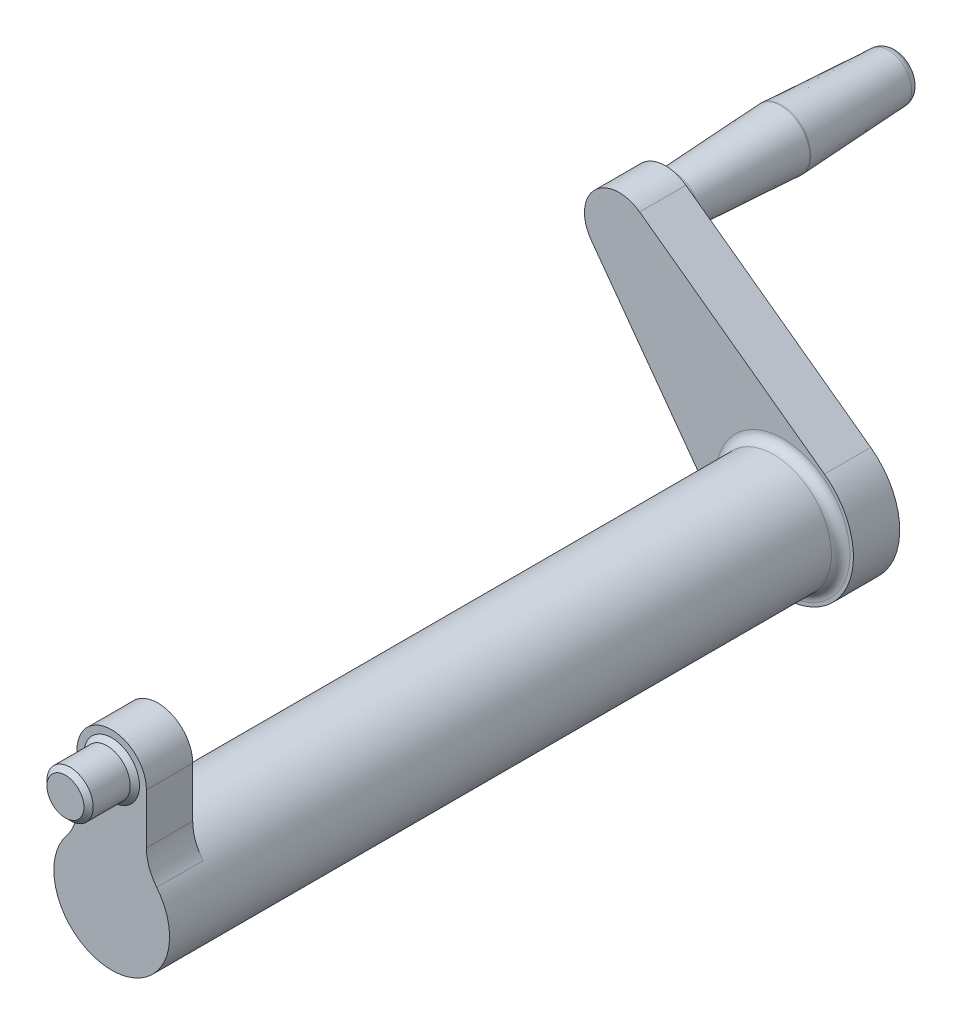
ISO-10303-21;
HEADER;
FILE_DESCRIPTION(('STEP AP214'),'2;1');
FILE_NAME('part.step','',(''),(''),'','','');
FILE_SCHEMA(('AUTOMOTIVE_DESIGN { 1 0 10303 214 1 1 1 1 }'));
ENDSEC;
DATA;
#1=APPLICATION_CONTEXT('core data for automotive mechanical design processes');
#2=APPLICATION_PROTOCOL_DEFINITION('international standard','automotive_design',2000,#1);
#3=PRODUCT_CONTEXT('',#1,'mechanical');
#4=PRODUCT('Part','Part','',(#3));
#5=PRODUCT_RELATED_PRODUCT_CATEGORY('part','',(#4));
#6=PRODUCT_DEFINITION_FORMATION('','',#4);
#7=PRODUCT_DEFINITION_CONTEXT('part definition',#1,'design');
#8=PRODUCT_DEFINITION('design','',#6,#7);
#9=PRODUCT_DEFINITION_SHAPE('','',#8);
#10=(LENGTH_UNIT() NAMED_UNIT(*) SI_UNIT(.MILLI.,.METRE.));
#11=(NAMED_UNIT(*) PLANE_ANGLE_UNIT() SI_UNIT($,.RADIAN.));
#12=(NAMED_UNIT(*) SI_UNIT($,.STERADIAN.) SOLID_ANGLE_UNIT());
#13=UNCERTAINTY_MEASURE_WITH_UNIT(LENGTH_MEASURE(1.E-05),#10,'distance_accuracy_value','');
#14=(GEOMETRIC_REPRESENTATION_CONTEXT(3) GLOBAL_UNCERTAINTY_ASSIGNED_CONTEXT((#13)) GLOBAL_UNIT_ASSIGNED_CONTEXT((#10,
#11,#12)) REPRESENTATION_CONTEXT('',''));
#15=CARTESIAN_POINT('',(0.,0.,0.));
#16=DIRECTION('',(0.,0.,1.));
#17=DIRECTION('',(1.,0.,0.));
#18=AXIS2_PLACEMENT_3D('',#15,#16,#17);
#19=CARTESIAN_POINT('',(0.,0.,145.));
#20=DIRECTION('',(0.,0.,-1.));
#21=DIRECTION('',(-1.,0.,0.));
#22=AXIS2_PLACEMENT_3D('',#19,#20,#21);
#23=CYLINDRICAL_SURFACE('',#22,12.5);
#24=CARTESIAN_POINT('',(0.,0.,12.));
#25=DIRECTION('',(0.,0.,-1.));
#26=DIRECTION('',(-1.,0.,0.));
#27=AXIS2_PLACEMENT_3D('',#24,#25,#26);
#28=CIRCLE('',#27,12.5);
#29=CARTESIAN_POINT('',(-12.5,0.,12.));
#30=VERTEX_POINT('',#29);
#31=EDGE_CURVE('E213',#30,#30,#28,.F.);
#32=ORIENTED_EDGE('',*,*,#31,.T.);
#33=EDGE_LOOP('',(#32));
#34=FACE_BOUND('',#33,.T.);
#35=CARTESIAN_POINT('',(0.,0.,155.));
#36=DIRECTION('',(0.,0.,1.));
#37=DIRECTION('',(1.,0.,0.));
#38=AXIS2_PLACEMENT_3D('',#35,#36,#37);
#39=CIRCLE('',#38,12.5);
#40=CARTESIAN_POINT('',(-9.72222222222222,7.85674201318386,155.));
#41=VERTEX_POINT('',#40);
#42=CARTESIAN_POINT('',(9.72222222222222,7.85674201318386,155.));
#43=VERTEX_POINT('',#42);
#44=EDGE_CURVE('E160',#41,#43,#39,.T.);
#45=ORIENTED_EDGE('',*,*,#44,.F.);
#46=DIRECTION('',(0.,0.,-1.));
#47=VECTOR('',#46,1.);
#48=CARTESIAN_POINT('',(-9.72222222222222,7.85674201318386,145.));
#49=LINE('',#48,#47);
#50=CARTESIAN_POINT('',(-9.72222222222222,7.85674201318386,145.));
#51=VERTEX_POINT('',#50);
#52=EDGE_CURVE('E197',#41,#51,#49,.T.);
#53=ORIENTED_EDGE('',*,*,#52,.T.);
#54=CARTESIAN_POINT('',(0.,0.,145.));
#55=DIRECTION('',(0.,0.,1.));
#56=DIRECTION('',(1.,0.,0.));
#57=AXIS2_PLACEMENT_3D('',#54,#55,#56);
#58=CIRCLE('',#57,12.5);
#59=CARTESIAN_POINT('',(9.72222222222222,7.85674201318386,145.));
#60=VERTEX_POINT('',#59);
#61=EDGE_CURVE('E181',#60,#51,#58,.T.);
#62=ORIENTED_EDGE('',*,*,#61,.F.);
#63=DIRECTION('',(0.,0.,-1.));
#64=VECTOR('',#63,1.);
#65=CARTESIAN_POINT('',(9.72222222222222,7.85674201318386,145.));
#66=LINE('',#65,#64);
#67=EDGE_CURVE('E195',#60,#43,#66,.F.);
#68=ORIENTED_EDGE('',*,*,#67,.T.);
#69=EDGE_LOOP('',(#45,#53,#62,#68));
#70=FACE_BOUND('',#69,.T.);
#71=ADVANCED_FACE('F37',(#34,#70),#23,.T.);
#72=CARTESIAN_POINT('',(0.,0.,145.));
#73=DIRECTION('',(0.,0.,1.));
#74=DIRECTION('',(1.,0.,0.));
#75=AXIS2_PLACEMENT_3D('',#72,#73,#74);
#76=PLANE('',#75);
#77=DIRECTION('',(0.,1.,0.));
#78=VECTOR('',#77,1.);
#79=CARTESIAN_POINT('',(7.5,25.,145.));
#80=LINE('',#79,#78);
#81=CARTESIAN_POINT('',(7.5,14.142135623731,145.));
#82=VERTEX_POINT('',#81);
#83=CARTESIAN_POINT('',(7.5,25.,145.));
#84=VERTEX_POINT('',#83);
#85=EDGE_CURVE('E156',#82,#84,#80,.T.);
#86=ORIENTED_EDGE('',*,*,#85,.F.);
#87=CARTESIAN_POINT('',(17.5,14.142135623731,145.));
#88=DIRECTION('',(0.,0.,1.));
#89=DIRECTION('',(1.,0.,0.));
#90=AXIS2_PLACEMENT_3D('',#87,#88,#89);
#91=CIRCLE('',#90,10.);
#92=EDGE_CURVE('E60',#82,#60,#91,.T.);
#93=ORIENTED_EDGE('',*,*,#92,.T.);
#94=ORIENTED_EDGE('',*,*,#61,.T.);
#95=CARTESIAN_POINT('',(-17.5,14.142135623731,145.));
#96=DIRECTION('',(0.,0.,1.));
#97=DIRECTION('',(1.,0.,0.));
#98=AXIS2_PLACEMENT_3D('',#95,#96,#97);
#99=CIRCLE('',#98,10.);
#100=CARTESIAN_POINT('',(-7.5,14.142135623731,145.));
#101=VERTEX_POINT('',#100);
#102=EDGE_CURVE('E204',#51,#101,#99,.T.);
#103=ORIENTED_EDGE('',*,*,#102,.T.);
#104=DIRECTION('',(0.,-1.,0.));
#105=VECTOR('',#104,1.);
#106=CARTESIAN_POINT('',(-7.5,25.,145.));
#107=LINE('',#106,#105);
#108=CARTESIAN_POINT('',(-7.5,25.,145.));
#109=VERTEX_POINT('',#108);
#110=EDGE_CURVE('E163',#109,#101,#107,.T.);
#111=ORIENTED_EDGE('',*,*,#110,.F.);
#112=CARTESIAN_POINT('',(0.,25.,145.));
#113=DIRECTION('',(0.,0.,1.));
#114=DIRECTION('',(1.,0.,0.));
#115=AXIS2_PLACEMENT_3D('',#112,#113,#114);
#116=CIRCLE('',#115,7.5);
#117=EDGE_CURVE('E172',#84,#109,#116,.T.);
#118=ORIENTED_EDGE('',*,*,#117,.F.);
#119=EDGE_LOOP('',(#86,#93,#94,#103,#111,#118));
#120=FACE_BOUND('',#119,.T.);
#121=ADVANCED_FACE('F253',(#120),#76,.F.);
#122=CARTESIAN_POINT('',(7.5,25.,155.));
#123=DIRECTION('',(-1.,0.,0.));
#124=DIRECTION('',(0.,-1.,0.));
#125=AXIS2_PLACEMENT_3D('',#122,#123,#124);
#126=PLANE('',#125);
#127=DIRECTION('',(0.,1.,0.));
#128=VECTOR('',#127,1.);
#129=CARTESIAN_POINT('',(7.5,25.,155.));
#130=LINE('',#129,#128);
#131=CARTESIAN_POINT('',(7.5,14.142135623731,155.));
#132=VERTEX_POINT('',#131);
#133=CARTESIAN_POINT('',(7.5,25.,155.));
#134=VERTEX_POINT('',#133);
#135=EDGE_CURVE('E162',#132,#134,#130,.T.);
#136=ORIENTED_EDGE('',*,*,#135,.F.);
#137=DIRECTION('',(0.,0.,1.));
#138=VECTOR('',#137,1.);
#139=CARTESIAN_POINT('',(7.5,14.142135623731,145.));
#140=LINE('',#139,#138);
#141=EDGE_CURVE('E202',#132,#82,#140,.F.);
#142=ORIENTED_EDGE('',*,*,#141,.T.);
#143=ORIENTED_EDGE('',*,*,#85,.T.);
#144=DIRECTION('',(0.,0.,-1.));
#145=VECTOR('',#144,1.);
#146=CARTESIAN_POINT('',(7.5,25.,155.));
#147=LINE('',#146,#145);
#148=EDGE_CURVE('E178',#134,#84,#147,.T.);
#149=ORIENTED_EDGE('',*,*,#148,.F.);
#150=EDGE_LOOP('',(#136,#142,#143,#149));
#151=FACE_BOUND('',#150,.T.);
#152=ADVANCED_FACE('F259',(#151),#126,.F.);
#153=CARTESIAN_POINT('',(0.,25.,155.));
#154=DIRECTION('',(0.,0.,-1.));
#155=DIRECTION('',(-1.,0.,0.));
#156=AXIS2_PLACEMENT_3D('',#153,#154,#155);
#157=CYLINDRICAL_SURFACE('',#156,7.5);
#158=ORIENTED_EDGE('',*,*,#117,.T.);
#159=DIRECTION('',(0.,0.,-1.));
#160=VECTOR('',#159,1.);
#161=CARTESIAN_POINT('',(-7.5,25.,155.));
#162=LINE('',#161,#160);
#163=CARTESIAN_POINT('',(-7.5,25.,155.));
#164=VERTEX_POINT('',#163);
#165=EDGE_CURVE('E170',#164,#109,#162,.T.);
#166=ORIENTED_EDGE('',*,*,#165,.F.);
#167=CARTESIAN_POINT('',(0.,25.,155.));
#168=DIRECTION('',(0.,0.,1.));
#169=DIRECTION('',(1.,0.,0.));
#170=AXIS2_PLACEMENT_3D('',#167,#168,#169);
#171=CIRCLE('',#170,7.5);
#172=EDGE_CURVE('E165',#134,#164,#171,.T.);
#173=ORIENTED_EDGE('',*,*,#172,.F.);
#174=ORIENTED_EDGE('',*,*,#148,.T.);
#175=EDGE_LOOP('',(#158,#166,#173,#174));
#176=FACE_BOUND('',#175,.T.);
#177=ADVANCED_FACE('F451',(#176),#157,.T.);
#178=CARTESIAN_POINT('',(-7.5,25.,155.));
#179=DIRECTION('',(1.,0.,0.));
#180=DIRECTION('',(0.,1.,0.));
#181=AXIS2_PLACEMENT_3D('',#178,#179,#180);
#182=PLANE('',#181);
#183=ORIENTED_EDGE('',*,*,#110,.T.);
#184=DIRECTION('',(0.,0.,1.));
#185=VECTOR('',#184,1.);
#186=CARTESIAN_POINT('',(-7.5,14.142135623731,155.));
#187=LINE('',#186,#185);
#188=CARTESIAN_POINT('',(-7.5,14.142135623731,155.));
#189=VERTEX_POINT('',#188);
#190=EDGE_CURVE('E200',#101,#189,#187,.T.);
#191=ORIENTED_EDGE('',*,*,#190,.T.);
#192=DIRECTION('',(0.,-1.,0.));
#193=VECTOR('',#192,1.);
#194=CARTESIAN_POINT('',(-7.5,25.,155.));
#195=LINE('',#194,#193);
#196=EDGE_CURVE('E167',#164,#189,#195,.T.);
#197=ORIENTED_EDGE('',*,*,#196,.F.);
#198=ORIENTED_EDGE('',*,*,#165,.T.);
#199=EDGE_LOOP('',(#183,#191,#197,#198));
#200=FACE_BOUND('',#199,.T.);
#201=ADVANCED_FACE('F442',(#200),#182,.F.);
#202=CARTESIAN_POINT('',(0.,0.,155.));
#203=DIRECTION('',(0.,0.,1.));
#204=DIRECTION('',(1.,0.,0.));
#205=AXIS2_PLACEMENT_3D('',#202,#203,#204);
#206=PLANE('',#205);
#207=CARTESIAN_POINT('',(0.,25.,155.));
#208=DIRECTION('',(0.,0.,1.));
#209=DIRECTION('',(1.,0.,0.));
#210=AXIS2_PLACEMENT_3D('',#207,#208,#209);
#211=CIRCLE('',#210,6.00000000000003);
#212=CARTESIAN_POINT('',(6.00000000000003,25.,155.));
#213=VERTEX_POINT('',#212);
#214=EDGE_CURVE('E192',#213,#213,#211,.F.);
#215=ORIENTED_EDGE('',*,*,#214,.T.);
#216=EDGE_LOOP('',(#215));
#217=FACE_BOUND('',#216,.T.);
#218=ORIENTED_EDGE('',*,*,#196,.T.);
#219=CARTESIAN_POINT('',(-17.5,14.142135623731,155.));
#220=DIRECTION('',(0.,0.,1.));
#221=DIRECTION('',(1.,0.,0.));
#222=AXIS2_PLACEMENT_3D('',#219,#220,#221);
#223=CIRCLE('',#222,10.);
#224=EDGE_CURVE('E206',#189,#41,#223,.F.);
#225=ORIENTED_EDGE('',*,*,#224,.T.);
#226=ORIENTED_EDGE('',*,*,#44,.T.);
#227=CARTESIAN_POINT('',(17.5,14.142135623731,155.));
#228=DIRECTION('',(0.,0.,1.));
#229=DIRECTION('',(1.,0.,0.));
#230=AXIS2_PLACEMENT_3D('',#227,#228,#229);
#231=CIRCLE('',#230,10.);
#232=EDGE_CURVE('E52',#43,#132,#231,.F.);
#233=ORIENTED_EDGE('',*,*,#232,.T.);
#234=ORIENTED_EDGE('',*,*,#135,.T.);
#235=ORIENTED_EDGE('',*,*,#172,.T.);
#236=EDGE_LOOP('',(#218,#225,#226,#233,#234,#235));
#237=FACE_BOUND('',#236,.T.);
#238=ADVANCED_FACE('F433',(#217,#237),#206,.T.);
#239=CARTESIAN_POINT('',(0.,25.,165.));
#240=DIRECTION('',(0.,0.,-1.));
#241=DIRECTION('',(-1.,0.,0.));
#242=AXIS2_PLACEMENT_3D('',#239,#240,#241);
#243=CYLINDRICAL_SURFACE('',#242,5.);
#244=CARTESIAN_POINT('',(0.,25.,164.));
#245=DIRECTION('',(0.,0.,1.));
#246=DIRECTION('',(1.,0.,0.));
#247=AXIS2_PLACEMENT_3D('',#244,#245,#246);
#248=CIRCLE('',#247,5.);
#249=CARTESIAN_POINT('',(5.,25.,164.));
#250=VERTEX_POINT('',#249);
#251=EDGE_CURVE('E189',#250,#250,#248,.F.);
#252=ORIENTED_EDGE('',*,*,#251,.T.);
#253=EDGE_LOOP('',(#252));
#254=FACE_BOUND('',#253,.T.);
#255=CARTESIAN_POINT('',(0.,25.,156.));
#256=DIRECTION('',(0.,0.,1.));
#257=DIRECTION('',(1.,0.,0.));
#258=AXIS2_PLACEMENT_3D('',#255,#256,#257);
#259=CIRCLE('',#258,5.);
#260=CARTESIAN_POINT('',(5.,25.,156.));
#261=VERTEX_POINT('',#260);
#262=EDGE_CURVE('E186',#261,#261,#259,.T.);
#263=ORIENTED_EDGE('',*,*,#262,.T.);
#264=EDGE_LOOP('',(#263));
#265=FACE_BOUND('',#264,.T.);
#266=ADVANCED_FACE('F424',(#254,#265),#243,.T.);
#267=CARTESIAN_POINT('',(0.,25.,165.));
#268=DIRECTION('',(0.,0.,1.));
#269=DIRECTION('',(1.,0.,0.));
#270=AXIS2_PLACEMENT_3D('',#267,#268,#269);
#271=PLANE('',#270);
#272=CARTESIAN_POINT('',(0.,25.,165.));
#273=DIRECTION('',(0.,0.,1.));
#274=DIRECTION('',(1.,0.,0.));
#275=AXIS2_PLACEMENT_3D('',#272,#273,#274);
#276=CIRCLE('',#275,3.99999999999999);
#277=CARTESIAN_POINT('',(3.99999999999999,25.,165.));
#278=VERTEX_POINT('',#277);
#279=EDGE_CURVE('E183',#278,#278,#276,.T.);
#280=ORIENTED_EDGE('',*,*,#279,.T.);
#281=EDGE_LOOP('',(#280));
#282=FACE_BOUND('',#281,.T.);
#283=ADVANCED_FACE('F275',(#282),#271,.T.);
#284=CARTESIAN_POINT('',(0.,25.,165.));
#285=DIRECTION('',(0.,0.,-1.));
#286=DIRECTION('',(-1.,0.,0.));
#287=AXIS2_PLACEMENT_3D('',#284,#285,#286);
#288=CONICAL_SURFACE('',#287,3.99999999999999,0.78539816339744);
#289=ORIENTED_EDGE('',*,*,#251,.F.);
#290=EDGE_LOOP('',(#289));
#291=FACE_BOUND('',#290,.T.);
#292=ORIENTED_EDGE('',*,*,#279,.F.);
#293=EDGE_LOOP('',(#292));
#294=FACE_BOUND('',#293,.T.);
#295=ADVANCED_FACE('F268',(#291,#294),#288,.T.);
#296=CARTESIAN_POINT('',(0.,25.,156.));
#297=DIRECTION('',(0.,0.,-1.));
#298=DIRECTION('',(-1.,0.,0.));
#299=AXIS2_PLACEMENT_3D('',#296,#297,#298);
#300=CONICAL_SURFACE('',#299,5.,0.78539816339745);
#301=ORIENTED_EDGE('',*,*,#214,.F.);
#302=EDGE_LOOP('',(#301));
#303=FACE_BOUND('',#302,.T.);
#304=ORIENTED_EDGE('',*,*,#262,.F.);
#305=EDGE_LOOP('',(#304));
#306=FACE_BOUND('',#305,.T.);
#307=ADVANCED_FACE('F274',(#303,#306),#300,.T.);
#308=CARTESIAN_POINT('',(-17.5,14.142135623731,145.));
#309=DIRECTION('',(0.,0.,-1.));
#310=DIRECTION('',(-1.,0.,0.));
#311=AXIS2_PLACEMENT_3D('',#308,#309,#310);
#312=CYLINDRICAL_SURFACE('',#311,10.);
#313=ORIENTED_EDGE('',*,*,#224,.F.);
#314=ORIENTED_EDGE('',*,*,#190,.F.);
#315=ORIENTED_EDGE('',*,*,#102,.F.);
#316=ORIENTED_EDGE('',*,*,#52,.F.);
#317=EDGE_LOOP('',(#313,#314,#315,#316));
#318=FACE_BOUND('',#317,.T.);
#319=ADVANCED_FACE('F281',(#318),#312,.F.);
#320=CARTESIAN_POINT('',(17.5,14.142135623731,145.));
#321=DIRECTION('',(0.,0.,-1.));
#322=DIRECTION('',(-1.,0.,0.));
#323=AXIS2_PLACEMENT_3D('',#320,#321,#322);
#324=CYLINDRICAL_SURFACE('',#323,10.);
#325=ORIENTED_EDGE('',*,*,#232,.F.);
#326=ORIENTED_EDGE('',*,*,#67,.F.);
#327=ORIENTED_EDGE('',*,*,#92,.F.);
#328=ORIENTED_EDGE('',*,*,#141,.F.);
#329=EDGE_LOOP('',(#325,#326,#327,#328));
#330=FACE_BOUND('',#329,.T.);
#331=ADVANCED_FACE('F285',(#330),#324,.F.);
#332=CARTESIAN_POINT('',(0.,0.,10.));
#333=DIRECTION('',(0.,0.,-1.));
#334=DIRECTION('',(-1.,0.,0.));
#335=AXIS2_PLACEMENT_3D('',#332,#333,#334);
#336=CYLINDRICAL_SURFACE('',#335,15.2580294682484);
#337=CARTESIAN_POINT('',(0.,0.,0.));
#338=DIRECTION('',(0.,0.,-1.));
#339=DIRECTION('',(-1.,0.,0.));
#340=AXIS2_PLACEMENT_3D('',#337,#338,#339);
#341=CIRCLE('',#340,15.2580294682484);
#342=CARTESIAN_POINT('',(8.98435635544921,12.3324289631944,0.));
#343=VERTEX_POINT('',#342);
#344=CARTESIAN_POINT('',(-12.3324289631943,-8.98435635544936,0.));
#345=VERTEX_POINT('',#344);
#346=EDGE_CURVE('E150',#343,#345,#341,.T.);
#347=ORIENTED_EDGE('',*,*,#346,.F.);
#348=DIRECTION('',(0.,0.,-1.));
#349=VECTOR('',#348,1.);
#350=CARTESIAN_POINT('',(8.98435635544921,12.3324289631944,10.));
#351=LINE('',#350,#349);
#352=CARTESIAN_POINT('',(8.98435635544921,12.3324289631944,10.));
#353=VERTEX_POINT('',#352);
#354=EDGE_CURVE('E141',#353,#343,#351,.T.);
#355=ORIENTED_EDGE('',*,*,#354,.F.);
#356=CARTESIAN_POINT('',(0.,0.,10.));
#357=DIRECTION('',(0.,0.,-1.));
#358=DIRECTION('',(-1.,0.,0.));
#359=AXIS2_PLACEMENT_3D('',#356,#357,#358);
#360=CIRCLE('',#359,15.2580294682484);
#361=CARTESIAN_POINT('',(-12.3324289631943,-8.98435635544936,10.));
#362=VERTEX_POINT('',#361);
#363=EDGE_CURVE('E135',#353,#362,#360,.T.);
#364=ORIENTED_EDGE('',*,*,#363,.T.);
#365=DIRECTION('',(0.,0.,-1.));
#366=VECTOR('',#365,1.);
#367=CARTESIAN_POINT('',(-12.3324289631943,-8.98435635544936,10.));
#368=LINE('',#367,#366);
#369=EDGE_CURVE('E117',#362,#345,#368,.T.);
#370=ORIENTED_EDGE('',*,*,#369,.T.);
#371=EDGE_LOOP('',(#347,#355,#364,#370));
#372=FACE_BOUND('',#371,.T.);
#373=ADVANCED_FACE('F140',(#372),#336,.T.);
#374=CARTESIAN_POINT('',(8.98435635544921,12.3324289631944,10.));
#375=DIRECTION('',(0.588828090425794,0.808258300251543,0.));
#376=DIRECTION('',(-0.808258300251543,0.588828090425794,0.));
#377=AXIS2_PLACEMENT_3D('',#374,#375,#376);
#378=PLANE('',#377);
#379=DIRECTION('',(0.808258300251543,-0.588828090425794,0.));
#380=VECTOR('',#379,1.);
#381=CARTESIAN_POINT('',(8.98435635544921,12.3324289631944,0.));
#382=LINE('',#381,#380);
#383=CARTESIAN_POINT('',(-30.9391283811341,41.4172763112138,0.));
#384=VERTEX_POINT('',#383);
#385=EDGE_CURVE('E142',#384,#343,#382,.T.);
#386=ORIENTED_EDGE('',*,*,#385,.F.);
#387=DIRECTION('',(0.,0.,-1.));
#388=VECTOR('',#387,1.);
#389=CARTESIAN_POINT('',(-30.9391283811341,41.4172763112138,10.));
#390=LINE('',#389,#388);
#391=CARTESIAN_POINT('',(-30.9391283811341,41.4172763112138,10.));
#392=VERTEX_POINT('',#391);
#393=EDGE_CURVE('E157',#392,#384,#390,.T.);
#394=ORIENTED_EDGE('',*,*,#393,.F.);
#395=DIRECTION('',(0.808258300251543,-0.588828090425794,0.));
#396=VECTOR('',#395,1.);
#397=CARTESIAN_POINT('',(8.98435635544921,12.3324289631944,10.));
#398=LINE('',#397,#396);
#399=EDGE_CURVE('E128',#392,#353,#398,.T.);
#400=ORIENTED_EDGE('',*,*,#399,.T.);
#401=ORIENTED_EDGE('',*,*,#354,.T.);
#402=EDGE_LOOP('',(#386,#394,#400,#401));
#403=FACE_BOUND('',#402,.T.);
#404=ADVANCED_FACE('F371',(#403),#378,.T.);
#405=CARTESIAN_POINT('',(-35.3553390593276,35.3553390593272,10.));
#406=DIRECTION('',(0.,0.,-1.));
#407=DIRECTION('',(-1.,0.,0.));
#408=AXIS2_PLACEMENT_3D('',#405,#406,#407);
#409=CYLINDRICAL_SURFACE('',#408,7.5);
#410=CARTESIAN_POINT('',(-35.3553390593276,35.3553390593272,0.));
#411=DIRECTION('',(0.,0.,-1.));
#412=DIRECTION('',(-1.,0.,0.));
#413=AXIS2_PLACEMENT_3D('',#410,#411,#412);
#414=CIRCLE('',#413,7.5);
#415=CARTESIAN_POINT('',(-41.4172763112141,30.9391283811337,0.));
#416=VERTEX_POINT('',#415);
#417=EDGE_CURVE('E145',#416,#384,#414,.T.);
#418=ORIENTED_EDGE('',*,*,#417,.F.);
#419=DIRECTION('',(0.,0.,-1.));
#420=VECTOR('',#419,1.);
#421=CARTESIAN_POINT('',(-41.4172763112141,30.9391283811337,10.));
#422=LINE('',#421,#420);
#423=CARTESIAN_POINT('',(-41.4172763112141,30.9391283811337,10.));
#424=VERTEX_POINT('',#423);
#425=EDGE_CURVE('E127',#424,#416,#422,.T.);
#426=ORIENTED_EDGE('',*,*,#425,.F.);
#427=CARTESIAN_POINT('',(-35.3553390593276,35.3553390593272,10.));
#428=DIRECTION('',(0.,0.,-1.));
#429=DIRECTION('',(-1.,0.,0.));
#430=AXIS2_PLACEMENT_3D('',#427,#428,#429);
#431=CIRCLE('',#430,7.5);
#432=EDGE_CURVE('E138',#424,#392,#431,.T.);
#433=ORIENTED_EDGE('',*,*,#432,.T.);
#434=ORIENTED_EDGE('',*,*,#393,.T.);
#435=EDGE_LOOP('',(#418,#426,#433,#434));
#436=FACE_BOUND('',#435,.T.);
#437=ADVANCED_FACE('F363',(#436),#409,.T.);
#438=CARTESIAN_POINT('',(-12.3324289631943,-8.98435635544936,10.));
#439=DIRECTION('',(-0.808258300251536,-0.588828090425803,0.));
#440=DIRECTION('',(0.588828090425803,-0.808258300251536,0.));
#441=AXIS2_PLACEMENT_3D('',#438,#439,#440);
#442=PLANE('',#441);
#443=DIRECTION('',(-0.588828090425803,0.808258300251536,0.));
#444=VECTOR('',#443,1.);
#445=CARTESIAN_POINT('',(-12.3324289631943,-8.98435635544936,0.));
#446=LINE('',#445,#444);
#447=EDGE_CURVE('E122',#345,#416,#446,.T.);
#448=ORIENTED_EDGE('',*,*,#447,.F.);
#449=ORIENTED_EDGE('',*,*,#369,.F.);
#450=DIRECTION('',(-0.588828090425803,0.808258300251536,0.));
#451=VECTOR('',#450,1.);
#452=CARTESIAN_POINT('',(-12.3324289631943,-8.98435635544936,10.));
#453=LINE('',#452,#451);
#454=EDGE_CURVE('E120',#362,#424,#453,.T.);
#455=ORIENTED_EDGE('',*,*,#454,.T.);
#456=ORIENTED_EDGE('',*,*,#425,.T.);
#457=EDGE_LOOP('',(#448,#449,#455,#456));
#458=FACE_BOUND('',#457,.T.);
#459=ADVANCED_FACE('F119',(#458),#442,.T.);
#460=CARTESIAN_POINT('',(0.,0.,10.));
#461=DIRECTION('',(0.,0.,-1.));
#462=DIRECTION('',(-1.,0.,0.));
#463=AXIS2_PLACEMENT_3D('',#460,#461,#462);
#464=PLANE('',#463);
#465=CARTESIAN_POINT('',(0.,0.,10.));
#466=DIRECTION('',(0.,0.,-1.));
#467=DIRECTION('',(-1.,0.,0.));
#468=AXIS2_PLACEMENT_3D('',#465,#466,#467);
#469=CIRCLE('',#468,14.5);
#470=CARTESIAN_POINT('',(-14.5,0.,10.));
#471=VERTEX_POINT('',#470);
#472=EDGE_CURVE('E210',#471,#471,#469,.T.);
#473=ORIENTED_EDGE('',*,*,#472,.T.);
#474=EDGE_LOOP('',(#473));
#475=FACE_BOUND('',#474,.T.);
#476=ORIENTED_EDGE('',*,*,#363,.F.);
#477=ORIENTED_EDGE('',*,*,#399,.F.);
#478=ORIENTED_EDGE('',*,*,#432,.F.);
#479=ORIENTED_EDGE('',*,*,#454,.F.);
#480=EDGE_LOOP('',(#476,#477,#478,#479));
#481=FACE_BOUND('',#480,.T.);
#482=ADVANCED_FACE('F133',(#475,#481),#464,.F.);
#483=CARTESIAN_POINT('',(0.,0.,0.));
#484=DIRECTION('',(0.,0.,1.));
#485=DIRECTION('',(1.,0.,0.));
#486=AXIS2_PLACEMENT_3D('',#483,#484,#485);
#487=PLANE('',#486);
#488=CARTESIAN_POINT('',(-35.3553390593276,35.3553390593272,0.));
#489=DIRECTION('',(0.,0.,1.));
#490=DIRECTION('',(1.,0.,0.));
#491=AXIS2_PLACEMENT_3D('',#488,#489,#490);
#492=CIRCLE('',#491,7.10756025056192);
#493=CARTESIAN_POINT('',(-28.2477788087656,35.3553390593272,0.));
#494=VERTEX_POINT('',#493);
#495=EDGE_CURVE('E11',#494,#494,#492,.T.);
#496=ORIENTED_EDGE('',*,*,#495,.T.);
#497=EDGE_LOOP('',(#496));
#498=FACE_BOUND('',#497,.T.);
#499=ORIENTED_EDGE('',*,*,#346,.T.);
#500=ORIENTED_EDGE('',*,*,#447,.T.);
#501=ORIENTED_EDGE('',*,*,#417,.T.);
#502=ORIENTED_EDGE('',*,*,#385,.T.);
#503=EDGE_LOOP('',(#499,#500,#501,#502));
#504=FACE_BOUND('',#503,.T.);
#505=ADVANCED_FACE('F265',(#498,#504),#487,.F.);
#506=CARTESIAN_POINT('',(0.,0.,12.));
#507=DIRECTION('',(0.,0.,-1.));
#508=DIRECTION('',(-1.,0.,0.));
#509=AXIS2_PLACEMENT_3D('',#506,#507,#508);
#510=TOROIDAL_SURFACE('',#509,14.5,2.);
#511=ORIENTED_EDGE('',*,*,#31,.F.);
#512=EDGE_LOOP('',(#511));
#513=FACE_BOUND('',#512,.T.);
#514=ORIENTED_EDGE('',*,*,#472,.F.);
#515=EDGE_LOOP('',(#514));
#516=FACE_BOUND('',#515,.T.);
#517=ADVANCED_FACE('F250',(#513,#516),#510,.F.);
#518=CARTESIAN_POINT('',(-35.3553390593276,35.3553390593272,0.));
#519=DIRECTION('',(0.,0.,-1.));
#520=DIRECTION('',(-1.,0.,0.));
#521=AXIS2_PLACEMENT_3D('',#518,#519,#520);
#522=CONICAL_SURFACE('',#521,5.,0.05235987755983);
#523=CARTESIAN_POINT('',(-35.3553390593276,35.3553390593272,-24.8953280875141));
#524=DIRECTION('',(0.,0.,-1.));
#525=DIRECTION('',(-1.,0.,0.));
#526=AXIS2_PLACEMENT_3D('',#523,#524,#525);
#527=CIRCLE('',#526,6.30470885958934);
#528=CARTESIAN_POINT('',(-41.6600479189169,35.3553390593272,-24.8953280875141));
#529=VERTEX_POINT('',#528);
#530=EDGE_CURVE('E45',#529,#529,#527,.F.);
#531=ORIENTED_EDGE('',*,*,#530,.T.);
#532=EDGE_LOOP('',(#531));
#533=FACE_BOUND('',#532,.T.);
#534=CARTESIAN_POINT('',(-35.3553390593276,35.3553390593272,-2.10467191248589));
#535=DIRECTION('',(0.,0.,-1.));
#536=DIRECTION('',(-1.,0.,0.));
#537=AXIS2_PLACEMENT_3D('',#534,#535,#536);
#538=CIRCLE('',#537,5.11030118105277);
#539=CARTESIAN_POINT('',(-40.4656402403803,35.3553390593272,-2.10467191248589));
#540=VERTEX_POINT('',#539);
#541=EDGE_CURVE('E225',#540,#540,#538,.T.);
#542=ORIENTED_EDGE('',*,*,#541,.T.);
#543=EDGE_LOOP('',(#542));
#544=FACE_BOUND('',#543,.T.);
#545=ADVANCED_FACE('F230',(#533,#544),#522,.T.);
#546=CARTESIAN_POINT('',(-35.3553390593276,35.3553390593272,-50.));
#547=DIRECTION('',(0.,0.,1.));
#548=DIRECTION('',(-1.,0.,0.));
#549=AXIS2_PLACEMENT_3D('',#546,#547,#548);
#550=CONICAL_SURFACE('',#549,5.,0.05235987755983);
#551=CARTESIAN_POINT('',(-35.3553390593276,35.3553390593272,-48.1046719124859));
#552=DIRECTION('',(0.,0.,1.));
#553=DIRECTION('',(1.,0.,0.));
#554=AXIS2_PLACEMENT_3D('',#551,#552,#553);
#555=CIRCLE('',#554,5.09932993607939);
#556=CARTESIAN_POINT('',(-30.2560091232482,35.3553390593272,-48.1046719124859));
#557=VERTEX_POINT('',#556);
#558=EDGE_CURVE('E222',#557,#557,#555,.T.);
#559=ORIENTED_EDGE('',*,*,#558,.T.);
#560=EDGE_LOOP('',(#559));
#561=FACE_BOUND('',#560,.T.);
#562=CARTESIAN_POINT('',(-35.3553390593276,35.3553390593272,-25.1046719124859));
#563=DIRECTION('',(0.,0.,1.));
#564=DIRECTION('',(1.,0.,0.));
#565=AXIS2_PLACEMENT_3D('',#562,#563,#564);
#566=CIRCLE('',#565,6.30470885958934);
#567=CARTESIAN_POINT('',(-29.0506301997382,35.3553390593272,-25.1046719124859));
#568=VERTEX_POINT('',#567);
#569=EDGE_CURVE('E219',#568,#568,#566,.F.);
#570=ORIENTED_EDGE('',*,*,#569,.T.);
#571=EDGE_LOOP('',(#570));
#572=FACE_BOUND('',#571,.T.);
#573=ADVANCED_FACE('F239',(#561,#572),#550,.T.);
#574=CARTESIAN_POINT('',(-35.3553390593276,35.3553390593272,-50.));
#575=DIRECTION('',(0.,0.,1.));
#576=DIRECTION('',(-1.,0.,0.));
#577=AXIS2_PLACEMENT_3D('',#574,#575,#576);
#578=PLANE('',#577);
#579=CARTESIAN_POINT('',(-35.3553390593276,35.3553390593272,-50.));
#580=DIRECTION('',(0.,0.,1.));
#581=DIRECTION('',(1.,0.,0.));
#582=AXIS2_PLACEMENT_3D('',#579,#580,#581);
#583=CIRCLE('',#582,3.10207086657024);
#584=CARTESIAN_POINT('',(-32.2532681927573,35.3553390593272,-50.));
#585=VERTEX_POINT('',#584);
#586=EDGE_CURVE('E216',#585,#585,#583,.F.);
#587=ORIENTED_EDGE('',*,*,#586,.T.);
#588=EDGE_LOOP('',(#587));
#589=FACE_BOUND('',#588,.T.);
#590=ADVANCED_FACE('F241',(#589),#578,.F.);
#591=CARTESIAN_POINT('',(-35.3553390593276,35.3553390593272,-48.));
#592=DIRECTION('',(0.,0.,1.));
#593=DIRECTION('',(1.,0.,0.));
#594=AXIS2_PLACEMENT_3D('',#591,#592,#593);
#595=TOROIDAL_SURFACE('',#594,3.10207086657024,2.);
#596=ORIENTED_EDGE('',*,*,#558,.F.);
#597=EDGE_LOOP('',(#596));
#598=FACE_BOUND('',#597,.T.);
#599=ORIENTED_EDGE('',*,*,#586,.F.);
#600=EDGE_LOOP('',(#599));
#601=FACE_BOUND('',#600,.T.);
#602=ADVANCED_FACE('F236',(#598,#601),#595,.T.);
#603=CARTESIAN_POINT('',(-35.3553390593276,35.3553390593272,-25.));
#604=DIRECTION('',(0.,0.,1.));
#605=DIRECTION('',(1.,0.,0.));
#606=AXIS2_PLACEMENT_3D('',#603,#604,#605);
#607=TOROIDAL_SURFACE('',#606,4.30744979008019,2.);
#608=ORIENTED_EDGE('',*,*,#530,.F.);
#609=EDGE_LOOP('',(#608));
#610=FACE_BOUND('',#609,.T.);
#611=ORIENTED_EDGE('',*,*,#569,.F.);
#612=EDGE_LOOP('',(#611));
#613=FACE_BOUND('',#612,.T.);
#614=ADVANCED_FACE('F233',(#610,#613),#607,.T.);
#615=CARTESIAN_POINT('',(-35.3553390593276,35.3553390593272,-2.));
#616=DIRECTION('',(0.,0.,1.));
#617=DIRECTION('',(1.,0.,0.));
#618=AXIS2_PLACEMENT_3D('',#615,#616,#617);
#619=TOROIDAL_SURFACE('',#618,7.10756025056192,2.);
#620=ORIENTED_EDGE('',*,*,#495,.F.);
#621=EDGE_LOOP('',(#620));
#622=FACE_BOUND('',#621,.T.);
#623=ORIENTED_EDGE('',*,*,#541,.F.);
#624=EDGE_LOOP('',(#623));
#625=FACE_BOUND('',#624,.T.);
#626=ADVANCED_FACE('F39',(#622,#625),#619,.F.);
#627=CLOSED_SHELL('',(#71,#121,#152,#177,#201,#238,#266,#283,#295,#307,#319,#331,#373,#404,#437,
#459,#482,#505,#517,#545,#573,#590,#602,#614,#626));
#628=MANIFOLD_SOLID_BREP('B2',#627);
#629=ADVANCED_BREP_SHAPE_REPRESENTATION('',(#18,#628),#14);
#630=SHAPE_DEFINITION_REPRESENTATION(#9,#629);
ENDSEC;
END-ISO-10303-21;
